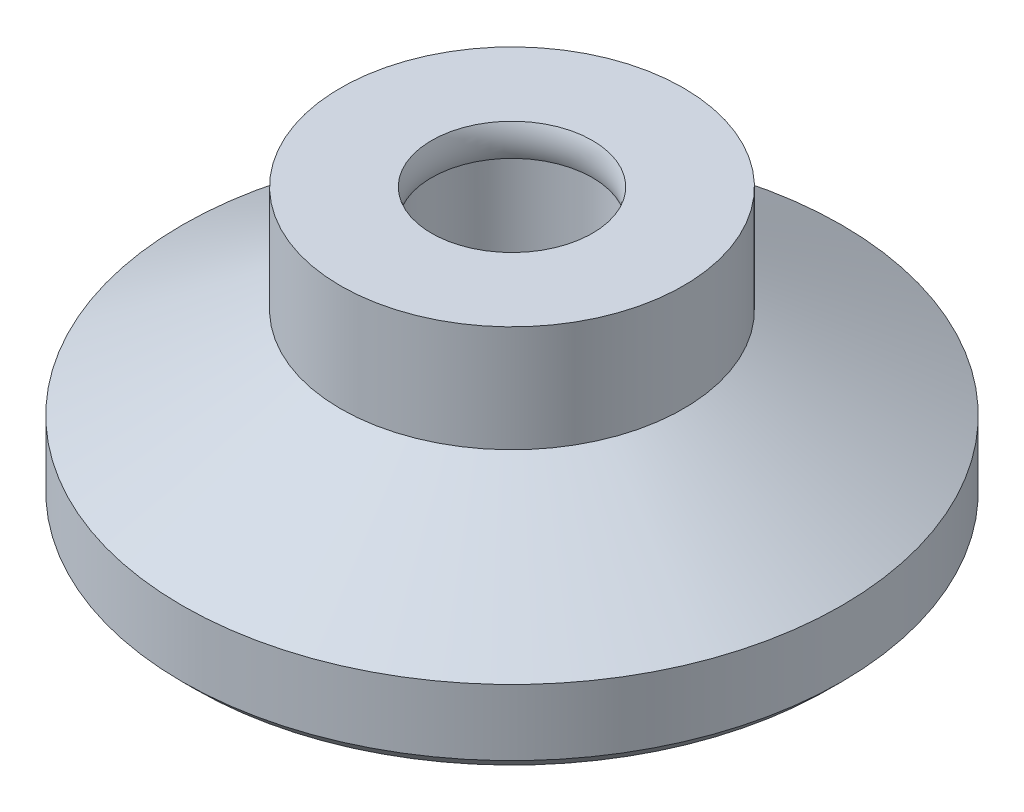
from build123d import *

# Parameters (mm, degrees)
SKETCH1_R      = 6.5
EXTRUDE1_DEPTH = 5.25
SKETCH3_R      = 12.5
EXTRUDE2_DEPTH = 3
CHAMFER1_SIZE  = 0.5


with BuildPart() as part:
    # Sketch1 → Extrude1 (new, symmetric)
    with BuildSketch(Plane(origin=(0, 0, 0), x_dir=(1, 0, 0), z_dir=(0, 1, 0))):
        with Locations(Location((0, 0, 0), (0, 0, 90))):
            Circle(SKETCH1_R)
    extrude(amount=EXTRUDE1_DEPTH, both=True)

    # Sketch3 → Extrude2 (add)
    with BuildSketch(Plane.XZ.offset(5.25)):
        with Locations(Location((0, 0, 0), (0, 0, 270))):
            Circle(SKETCH3_R)
    extrude(amount=-EXTRUDE2_DEPTH)

    # Sketch4 → Revolve1 (revolve)
    with BuildSketch(Plane.XY, mode=Mode.PRIVATE) as revolve1_sk:
        Polygon((-12.5, -2.25), (-6.5, 1.214101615), (-6.5, -2.25), align=None)
    revolve(revolve1_sk.sketch.rotate(Axis((0, 5.25, 0), (0, -1, 0)), 90), axis=Axis((0, 5.25, 0), (0, -1, 0)))

    # Chamfer1
    chamfer1_edges = [part.edges().sort_by_distance(p)[0] for p in [
        (0, -5.25, 12.5),
    ]]
    chamfer(chamfer1_edges, length=CHAMFER1_SIZE)

    # Sketch5 → Cut-Revolve1 (revolve, cut)
    with BuildSketch(Plane.XY, mode=Mode.PRIVATE) as cut_revolve1_sk:
        with BuildLine():
            Line((0, 5.25), (3.05, 5.25))
            ThreePointArc((3.05, 5.25), (2.928, 4.64), (3.05, 4.03))
            Line((3.05, 4.03), (3.05, -0.489081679))
            Line((3.05, -0.489081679), (0, -2.25))
            Line((0, -2.25), (0, 5.25))
        make_face()
    revolve(cut_revolve1_sk.sketch.rotate(Axis((0, 0, 0), (0, 1, 0)), 270), axis=Axis((0, 0, 0), (0, 1, 0)), mode=Mode.SUBTRACT)


solid = part.part
